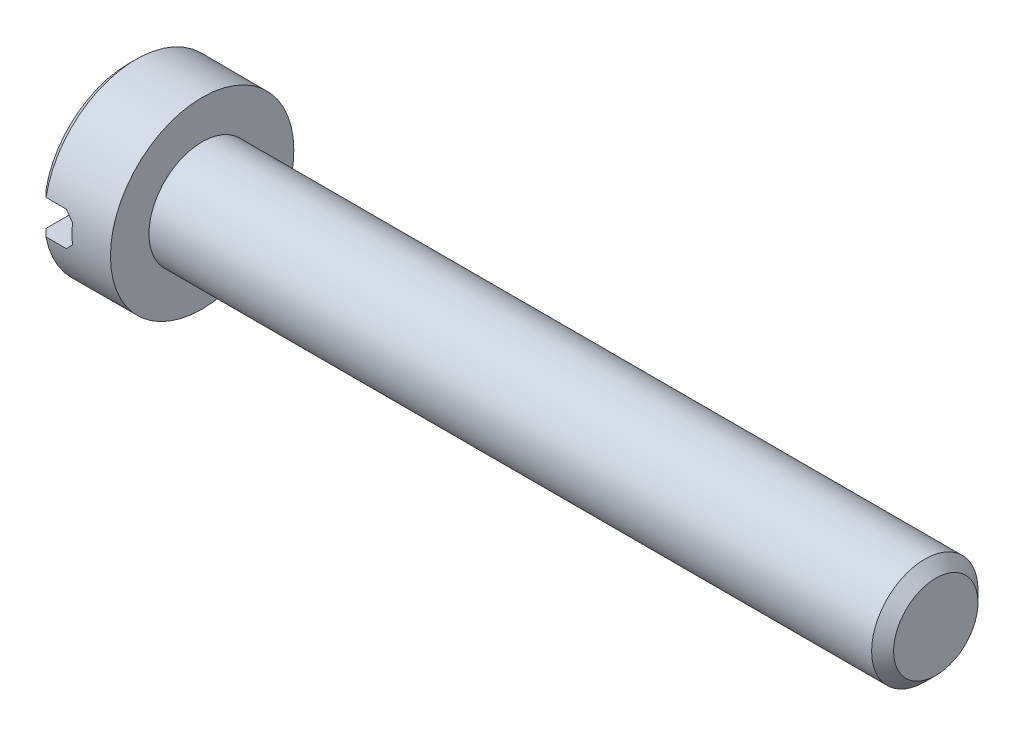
from build123d import *

# Parameters (mm, degrees)
ENL_V_MAT_EXTRU_1_DEPTH = 5
ESQUISSE3_R             = 1.45
EXTRUSION1_DEPTH        = 20
CHANFREIN1_SIZE         = 0.3


with BuildPart() as part:
    # Esquisse1 → R_volution1 (revolve)
    with BuildSketch(Plane.XY, mode=Mode.PRIVATE) as r_volution1_sk:
        Polygon((0, 0), (0, 2.3), (0.2, 2.5), (2, 2.5), (2, 0), align=None)
    revolve(r_volution1_sk.sketch.rotate(Axis((0, 0, 0), (1, 0, 0)), 90), axis=Axis((0, 0, 0), (1, 0, 0)))

    # Esquisse2 → Enl_v. mat.-Extru.1 (cut, symmetric)
    with BuildSketch(Plane.XY):
        Polygon((0, 0.465549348), (0.753445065, 0.465549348), (0.953445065, 0.265549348), (0.953445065, -0.265549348), (0.753445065, -0.465549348), (0, -0.465549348), align=None)
    extrude(amount=ENL_V_MAT_EXTRU_1_DEPTH, both=True, mode=Mode.SUBTRACT)

    # Esquisse3 → Extrusion1 (add)
    with BuildSketch(Plane(origin=(2, 0, 0), x_dir=(0, 0, -1), z_dir=(1, 0, 0))):
        with Locations(Location((0, 0, 0), (0, 0, 180))):
            Circle(ESQUISSE3_R)
    extrude(amount=EXTRUSION1_DEPTH)

    # Chanfrein1
    chanfrein1_edges = [part.edges().sort_by_distance(p)[0] for p in [
        (22, 0, -1.45),
    ]]
    chamfer(chanfrein1_edges, length=CHANFREIN1_SIZE)


solid = part.part
